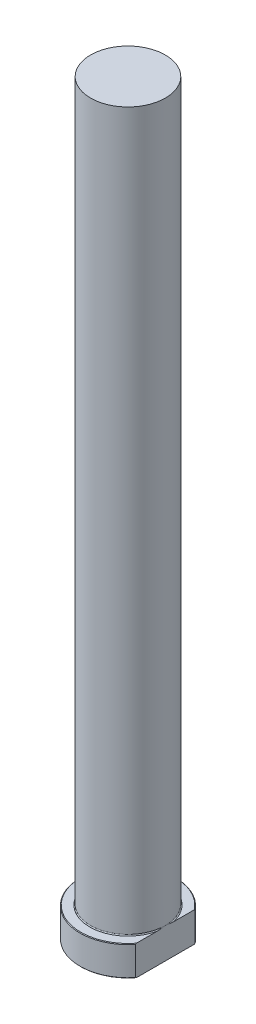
ISO-10303-21;
HEADER;
FILE_DESCRIPTION(('STEP AP214'),'2;1');
FILE_NAME('part.step','',(''),(''),'','','');
FILE_SCHEMA(('AUTOMOTIVE_DESIGN { 1 0 10303 214 1 1 1 1 }'));
ENDSEC;
DATA;
#1=APPLICATION_CONTEXT('core data for automotive mechanical design processes');
#2=APPLICATION_PROTOCOL_DEFINITION('international standard','automotive_design',2000,#1);
#3=PRODUCT_CONTEXT('',#1,'mechanical');
#4=PRODUCT('Part','Part','',(#3));
#5=PRODUCT_RELATED_PRODUCT_CATEGORY('part','',(#4));
#6=PRODUCT_DEFINITION_FORMATION('','',#4);
#7=PRODUCT_DEFINITION_CONTEXT('part definition',#1,'design');
#8=PRODUCT_DEFINITION('design','',#6,#7);
#9=PRODUCT_DEFINITION_SHAPE('','',#8);
#10=(LENGTH_UNIT() NAMED_UNIT(*) SI_UNIT(.MILLI.,.METRE.));
#11=(NAMED_UNIT(*) PLANE_ANGLE_UNIT() SI_UNIT($,.RADIAN.));
#12=(NAMED_UNIT(*) SI_UNIT($,.STERADIAN.) SOLID_ANGLE_UNIT());
#13=UNCERTAINTY_MEASURE_WITH_UNIT(LENGTH_MEASURE(1.E-05),#10,'distance_accuracy_value','');
#14=(GEOMETRIC_REPRESENTATION_CONTEXT(3) GLOBAL_UNCERTAINTY_ASSIGNED_CONTEXT((#13)) GLOBAL_UNIT_ASSIGNED_CONTEXT((#10,
#11,#12)) REPRESENTATION_CONTEXT('',''));
#15=CARTESIAN_POINT('',(0.,0.,0.));
#16=DIRECTION('',(0.,0.,1.));
#17=DIRECTION('',(1.,0.,0.));
#18=AXIS2_PLACEMENT_3D('',#15,#16,#17);
#19=CARTESIAN_POINT('',(0.,0.,0.));
#20=DIRECTION('',(0.,-1.,0.));
#21=DIRECTION('',(0.,0.,-1.));
#22=AXIS2_PLACEMENT_3D('',#19,#20,#21);
#23=PLANE('',#22);
#24=CARTESIAN_POINT('',(0.,0.,0.));
#25=DIRECTION('',(0.,-1.,0.));
#26=DIRECTION('',(0.,0.,-1.));
#27=AXIS2_PLACEMENT_3D('',#24,#25,#26);
#28=CIRCLE('',#27,15.8);
#29=CARTESIAN_POINT('',(12.5,0.,9.6638501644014));
#30=VERTEX_POINT('',#29);
#31=CARTESIAN_POINT('',(12.5,0.,-9.6638501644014));
#32=VERTEX_POINT('',#31);
#33=EDGE_CURVE('E98',#30,#32,#28,.T.);
#34=ORIENTED_EDGE('',*,*,#33,.T.);
#35=DIRECTION('',(0.,0.,1.));
#36=VECTOR('',#35,1.);
#37=CARTESIAN_POINT('',(12.5,0.,-9.98749217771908));
#38=LINE('',#37,#36);
#39=EDGE_CURVE('E83',#32,#30,#38,.T.);
#40=ORIENTED_EDGE('',*,*,#39,.T.);
#41=EDGE_LOOP('',(#34,#40));
#42=FACE_BOUND('',#41,.T.);
#43=ADVANCED_FACE('F32',(#42),#23,.T.);
#44=CARTESIAN_POINT('',(0.,259.958771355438,0.));
#45=DIRECTION('',(0.,1.,0.));
#46=DIRECTION('',(0.,0.,1.));
#47=AXIS2_PLACEMENT_3D('',#44,#45,#46);
#48=CYLINDRICAL_SURFACE('',#47,16.);
#49=CARTESIAN_POINT('',(0.,9.80000000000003,0.));
#50=DIRECTION('',(0.,1.,0.));
#51=DIRECTION('',(0.,0.,1.));
#52=AXIS2_PLACEMENT_3D('',#49,#50,#51);
#53=CIRCLE('',#52,16.);
#54=CARTESIAN_POINT('',(12.5,9.80000000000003,9.98749217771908));
#55=VERTEX_POINT('',#54);
#56=CARTESIAN_POINT('',(12.5,9.80000000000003,-9.98749217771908));
#57=VERTEX_POINT('',#56);
#58=EDGE_CURVE('E104',#55,#57,#53,.F.);
#59=ORIENTED_EDGE('',*,*,#58,.T.);
#60=DIRECTION('',(0.,-1.,0.));
#61=VECTOR('',#60,1.);
#62=CARTESIAN_POINT('',(12.5,250.,-9.98749217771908));
#63=LINE('',#62,#61);
#64=CARTESIAN_POINT('',(12.5,0.199999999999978,-9.98749217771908));
#65=VERTEX_POINT('',#64);
#66=EDGE_CURVE('E183',#57,#65,#63,.T.);
#67=ORIENTED_EDGE('',*,*,#66,.T.);
#68=CARTESIAN_POINT('',(0.,0.199999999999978,0.));
#69=DIRECTION('',(0.,-1.,0.));
#70=DIRECTION('',(0.,0.,-1.));
#71=AXIS2_PLACEMENT_3D('',#68,#69,#70);
#72=CIRCLE('',#71,16.);
#73=CARTESIAN_POINT('',(12.5,0.199999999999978,9.98749217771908));
#74=VERTEX_POINT('',#73);
#75=EDGE_CURVE('E100',#65,#74,#72,.F.);
#76=ORIENTED_EDGE('',*,*,#75,.T.);
#77=DIRECTION('',(0.,-1.,0.));
#78=VECTOR('',#77,1.);
#79=CARTESIAN_POINT('',(12.5,250.,9.98749217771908));
#80=LINE('',#79,#78);
#81=EDGE_CURVE('E93',#55,#74,#80,.T.);
#82=ORIENTED_EDGE('',*,*,#81,.F.);
#83=EDGE_LOOP('',(#59,#67,#76,#82));
#84=FACE_BOUND('',#83,.T.);
#85=ADVANCED_FACE('F158',(#84),#48,.T.);
#86=CARTESIAN_POINT('',(-16.,10.,0.));
#87=DIRECTION('',(0.,1.,0.));
#88=DIRECTION('',(0.,0.,1.));
#89=AXIS2_PLACEMENT_3D('',#86,#87,#88);
#90=PLANE('',#89);
#91=CARTESIAN_POINT('',(0.,10.,0.));
#92=DIRECTION('',(0.,1.,0.));
#93=DIRECTION('',(0.,0.,1.));
#94=AXIS2_PLACEMENT_3D('',#91,#92,#93);
#95=CIRCLE('',#94,15.8);
#96=CARTESIAN_POINT('',(12.5,10.,-9.66385016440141));
#97=VERTEX_POINT('',#96);
#98=CARTESIAN_POINT('',(12.5,10.,9.66385016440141));
#99=VERTEX_POINT('',#98);
#100=EDGE_CURVE('E178',#97,#99,#95,.T.);
#101=ORIENTED_EDGE('',*,*,#100,.T.);
#102=DIRECTION('',(0.,0.,-1.));
#103=VECTOR('',#102,1.);
#104=CARTESIAN_POINT('',(12.5,10.,0.));
#105=LINE('',#104,#103);
#106=CARTESIAN_POINT('',(12.5,10.,2.75499546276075));
#107=VERTEX_POINT('',#106);
#108=EDGE_CURVE('E57',#99,#107,#105,.T.);
#109=ORIENTED_EDGE('',*,*,#108,.T.);
#110=CARTESIAN_POINT('',(0.,10.,0.));
#111=DIRECTION('',(0.,1.,0.));
#112=DIRECTION('',(0.,0.,1.));
#113=AXIS2_PLACEMENT_3D('',#110,#111,#112);
#114=CIRCLE('',#113,12.8);
#115=CARTESIAN_POINT('',(12.5,10.,-2.75499546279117));
#116=VERTEX_POINT('',#115);
#117=EDGE_CURVE('E107',#107,#116,#114,.F.);
#118=ORIENTED_EDGE('',*,*,#117,.T.);
#119=EDGE_CURVE('E136',#116,#97,#105,.T.);
#120=ORIENTED_EDGE('',*,*,#119,.T.);
#121=EDGE_LOOP('',(#101,#109,#118,#120));
#122=FACE_BOUND('',#121,.T.);
#123=ADVANCED_FACE('F147',(#122),#90,.T.);
#124=CARTESIAN_POINT('',(0.,10.,0.));
#125=DIRECTION('',(0.,-1.,0.));
#126=DIRECTION('',(0.,0.,-1.));
#127=AXIS2_PLACEMENT_3D('',#124,#125,#126);
#128=CONICAL_SURFACE('',#127,15.8,0.785398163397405);
#129=ORIENTED_EDGE('',*,*,#58,.F.);
#130=CARTESIAN_POINT('',(12.5,0.520063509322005,21.9732835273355));
#131=CARTESIAN_POINT('',(12.5,0.802025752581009,21.6488770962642));
#132=CARTESIAN_POINT('',(12.5,1.08313217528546,21.3237240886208));
#133=CARTESIAN_POINT('',(12.5,1.64338244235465,20.6717229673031));
#134=CARTESIAN_POINT('',(12.5,1.92252625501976,20.3448748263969));
#135=CARTESIAN_POINT('',(12.5,2.47872061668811,19.6891394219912));
#136=CARTESIAN_POINT('',(12.5,2.75577013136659,19.3602512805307));
#137=CARTESIAN_POINT('',(12.5,3.30732757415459,18.7003513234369));
#138=CARTESIAN_POINT('',(12.5,3.58183551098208,18.3693395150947));
#139=CARTESIAN_POINT('',(12.5,4.13404626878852,17.6974852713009));
#140=CARTESIAN_POINT('',(12.5,4.41168315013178,17.356588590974));
#141=CARTESIAN_POINT('',(12.5,4.96342557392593,16.6719500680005));
#142=CARTESIAN_POINT('',(12.5,5.23753113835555,16.3282082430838));
#143=CARTESIAN_POINT('',(12.5,5.78155974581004,15.6375575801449));
#144=CARTESIAN_POINT('',(12.5,6.0514837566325,15.2906495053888));
#145=CARTESIAN_POINT('',(12.5,6.5864910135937,14.5931154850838));
#146=CARTESIAN_POINT('',(12.5,6.85157426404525,14.2424895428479));
#147=CARTESIAN_POINT('',(12.5,7.37633965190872,13.5365100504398));
#148=CARTESIAN_POINT('',(12.5,7.63601439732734,13.1811509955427));
#149=CARTESIAN_POINT('',(12.5,8.14848411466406,12.4654890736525));
#150=CARTESIAN_POINT('',(12.5,8.4012790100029,12.1051861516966));
#151=CARTESIAN_POINT('',(12.5,8.89877262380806,11.3785626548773));
#152=CARTESIAN_POINT('',(12.5,9.14346420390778,11.0122371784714));
#153=CARTESIAN_POINT('',(12.5,9.62269650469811,10.2729925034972));
#154=CARTESIAN_POINT('',(12.5,9.85723744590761,9.90007344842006));
#155=CARTESIAN_POINT('',(12.5,10.3121733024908,9.14938704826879));
#156=CARTESIAN_POINT('',(12.5,10.5326589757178,8.77167495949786));
#157=CARTESIAN_POINT('',(12.5,10.9584323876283,8.00766886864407));
#158=CARTESIAN_POINT('',(12.5,11.1637182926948,7.62137383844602));
#159=CARTESIAN_POINT('',(12.5,11.5550521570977,6.83979556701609));
#160=CARTESIAN_POINT('',(12.5,11.7411279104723,6.44452635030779));
#161=CARTESIAN_POINT('',(12.5,12.0896891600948,5.64379531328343));
#162=CARTESIAN_POINT('',(12.5,12.2521837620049,5.23833749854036));
#163=CARTESIAN_POINT('',(12.5,12.5515074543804,4.40750298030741));
#164=CARTESIAN_POINT('',(12.5,12.6876692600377,3.98188300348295));
#165=CARTESIAN_POINT('',(12.5,12.9230664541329,3.12036018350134));
#166=CARTESIAN_POINT('',(12.5,13.0223077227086,2.6844589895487));
#167=CARTESIAN_POINT('',(12.5,13.1386499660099,2.02637177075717));
#168=CARTESIAN_POINT('',(12.5,13.1719581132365,1.80697979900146));
#169=CARTESIAN_POINT('',(12.5,13.227389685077,1.36679892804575));
#170=CARTESIAN_POINT('',(12.5,13.2495147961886,1.14601024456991));
#171=CARTESIAN_POINT('',(12.5,13.2821590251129,0.703578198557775));
#172=CARTESIAN_POINT('',(12.5,13.2926782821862,0.481934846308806));
#173=CARTESIAN_POINT('',(12.5,13.3019073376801,0.0383999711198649));
#174=CARTESIAN_POINT('',(12.5,13.300617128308,-0.18349155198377));
#175=CARTESIAN_POINT('',(12.5,13.2862386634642,-0.627300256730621));
#176=CARTESIAN_POINT('',(12.5,13.2731286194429,-0.849216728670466));
#177=CARTESIAN_POINT('',(12.5,13.2353379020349,-1.2920567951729));
#178=CARTESIAN_POINT('',(12.5,13.2106571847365,-1.51298038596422));
#179=CARTESIAN_POINT('',(12.5,13.150182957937,-1.95331306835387));
#180=CARTESIAN_POINT('',(12.5,13.114388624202,-2.17272204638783));
#181=CARTESIAN_POINT('',(12.5,13.032312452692,-2.60958138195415));
#182=CARTESIAN_POINT('',(12.5,12.9860290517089,-2.8270314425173));
#183=CARTESIAN_POINT('',(12.5,12.8318007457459,-3.47896053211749));
#184=CARTESIAN_POINT('',(12.5,12.7089145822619,-3.90995974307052));
#185=CARTESIAN_POINT('',(12.5,12.4301044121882,-4.76088311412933));
#186=CARTESIAN_POINT('',(12.5,12.2741797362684,-5.1808070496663));
#187=CARTESIAN_POINT('',(12.5,11.8998555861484,-6.09704545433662));
#188=CARTESIAN_POINT('',(12.5,11.6752155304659,-6.59079268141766));
#189=CARTESIAN_POINT('',(12.5,11.1959254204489,-7.56361802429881));
#190=CARTESIAN_POINT('',(12.5,10.941258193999,-8.04268754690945));
#191=CARTESIAN_POINT('',(12.5,10.4085643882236,-8.98884891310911));
#192=CARTESIAN_POINT('',(12.5,10.1304909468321,-9.4559141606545));
#193=CARTESIAN_POINT('',(12.5,9.55679554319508,-10.3789360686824));
#194=CARTESIAN_POINT('',(12.5,9.26117703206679,-10.8348948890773));
#195=CARTESIAN_POINT('',(12.5,8.65460060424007,-11.7400212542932));
#196=CARTESIAN_POINT('',(12.5,8.34356847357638,-12.1891388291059));
#197=CARTESIAN_POINT('',(12.5,7.71056360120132,-13.0795913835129));
#198=CARTESIAN_POINT('',(12.5,7.38859046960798,-13.520926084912));
#199=CARTESIAN_POINT('',(12.5,6.73627073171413,-14.3965599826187));
#200=CARTESIAN_POINT('',(12.5,6.40593412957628,-14.8308666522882));
#201=CARTESIAN_POINT('',(12.5,5.73818513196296,-15.6939842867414));
#202=CARTESIAN_POINT('',(12.5,5.40077283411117,-16.1227953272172));
#203=CARTESIAN_POINT('',(12.5,4.69065889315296,-17.0127103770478));
#204=CARTESIAN_POINT('',(12.5,4.31743190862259,-17.4733945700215));
#205=CARTESIAN_POINT('',(12.5,3.56536441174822,-18.3901509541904));
#206=CARTESIAN_POINT('',(12.5,3.18652389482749,-18.846223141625));
#207=CARTESIAN_POINT('',(12.5,2.42850462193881,-19.7493414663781));
#208=CARTESIAN_POINT('',(12.5,2.04937794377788,-20.196431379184));
#209=CARTESIAN_POINT('',(12.5,1.28737664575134,-21.0872319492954));
#210=CARTESIAN_POINT('',(12.5,0.90450289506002,-21.5309433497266));
#211=CARTESIAN_POINT('',(12.5,0.520063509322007,-21.9732835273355));
#212=B_SPLINE_CURVE_WITH_KNOTS('',3,(#130,#131,#132,#133,#134,#135,#136,#137,#138,#139,#140,
#141,#142,#143,#144,#145,#146,#147,#148,#149,#150,#151,#152,#153,#154,#155,#156,#157,#158,#159,
#160,#161,#162,#163,#164,#165,#166,#167,#168,#169,#170,#171,#172,#173,#174,#175,#176,#177,#178,
#179,#180,#181,#182,#183,#184,#185,#186,#187,#188,#189,#190,#191,#192,#193,#194,#195,#196,#197,
#198,#199,#200,#201,#202,#203,#204,#205,#206,#207,#208,#209,#210,#211),.UNSPECIFIED.,.F.,.F.,(4,
2,2,2,2,2,2,2,2,2,2,2,2,2,2,2,2,2,2,2,2,2,2,2,2,2,2,2,2,2,2,2,2,2,2,2,2,2,2,2,4),(0.,
1.2894511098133,2.57892299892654,3.86899482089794,5.15906221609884,6.47799420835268,
7.79691798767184,9.11553180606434,10.4341444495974,11.7544545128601,13.0747792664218,
14.3962377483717,15.7176675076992,17.0294519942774,18.3413944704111,19.6514113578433,
20.9609210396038,22.3001940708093,23.6392537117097,24.3047314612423,24.9701088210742,
25.635478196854,26.3008480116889,26.9674468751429,27.6340482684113,28.3006991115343,
28.9674493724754,30.3101828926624,31.6529436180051,33.2788964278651,34.9057836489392,
36.5360093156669,38.1659153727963,39.8046231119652,41.4433893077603,43.0802801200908,
44.7171483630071,46.4957886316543,48.2744303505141,50.0329971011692,51.7911651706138),.UNSPECIFIED.);
#213=EDGE_CURVE('E135',#55,#99,#212,.T.);
#214=ORIENTED_EDGE('',*,*,#213,.T.);
#215=ORIENTED_EDGE('',*,*,#100,.F.);
#216=EDGE_CURVE('E127',#97,#57,#212,.T.);
#217=ORIENTED_EDGE('',*,*,#216,.T.);
#218=EDGE_LOOP('',(#129,#214,#215,#217));
#219=FACE_BOUND('',#218,.T.);
#220=ADVANCED_FACE('F143',(#219),#128,.T.);
#221=CARTESIAN_POINT('',(0.,0.199999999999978,0.));
#222=DIRECTION('',(0.,1.,0.));
#223=DIRECTION('',(0.,0.,1.));
#224=AXIS2_PLACEMENT_3D('',#221,#222,#223);
#225=CONICAL_SURFACE('',#224,16.,0.785398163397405);
#226=ORIENTED_EDGE('',*,*,#75,.F.);
#227=CARTESIAN_POINT('',(12.5,9.47993649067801,-21.9732835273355));
#228=CARTESIAN_POINT('',(12.5,9.197974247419,-21.6488770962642));
#229=CARTESIAN_POINT('',(12.5,8.91686782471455,-21.3237240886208));
#230=CARTESIAN_POINT('',(12.5,8.35661755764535,-20.6717229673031));
#231=CARTESIAN_POINT('',(12.5,8.07747374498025,-20.3448748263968));
#232=CARTESIAN_POINT('',(12.5,7.52127938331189,-19.6891394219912));
#233=CARTESIAN_POINT('',(12.5,7.24422986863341,-19.3602512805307));
#234=CARTESIAN_POINT('',(12.5,6.69267242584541,-18.7003513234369));
#235=CARTESIAN_POINT('',(12.5,6.41816448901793,-18.3693395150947));
#236=CARTESIAN_POINT('',(12.5,5.86595373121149,-17.6974852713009));
#237=CARTESIAN_POINT('',(12.5,5.58831684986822,-17.356588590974));
#238=CARTESIAN_POINT('',(12.5,5.03657442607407,-16.6719500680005));
#239=CARTESIAN_POINT('',(12.5,4.76246886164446,-16.3282082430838));
#240=CARTESIAN_POINT('',(12.5,4.21844025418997,-15.6375575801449));
#241=CARTESIAN_POINT('',(12.5,3.9485162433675,-15.2906495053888));
#242=CARTESIAN_POINT('',(12.5,3.41350898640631,-14.5931154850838));
#243=CARTESIAN_POINT('',(12.5,3.14842573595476,-14.2424895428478));
#244=CARTESIAN_POINT('',(12.5,2.62366034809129,-13.5365100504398));
#245=CARTESIAN_POINT('',(12.5,2.36398560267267,-13.1811509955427));
#246=CARTESIAN_POINT('',(12.5,1.85151588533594,-12.4654890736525));
#247=CARTESIAN_POINT('',(12.5,1.5987209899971,-12.1051861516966));
#248=CARTESIAN_POINT('',(12.5,1.10122737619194,-11.3785626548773));
#249=CARTESIAN_POINT('',(12.5,0.85653579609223,-11.0122371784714));
#250=CARTESIAN_POINT('',(12.5,0.377303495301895,-10.2729925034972));
#251=CARTESIAN_POINT('',(12.5,0.142762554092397,-9.90007344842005));
#252=CARTESIAN_POINT('',(12.5,-0.312173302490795,-9.14938704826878));
#253=CARTESIAN_POINT('',(12.5,-0.532658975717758,-8.77167495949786));
#254=CARTESIAN_POINT('',(12.5,-0.95843238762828,-8.00766886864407));
#255=CARTESIAN_POINT('',(12.5,-1.16371829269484,-7.62137383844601));
#256=CARTESIAN_POINT('',(12.5,-1.55505215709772,-6.83979556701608));
#257=CARTESIAN_POINT('',(12.5,-1.74112791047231,-6.44452635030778));
#258=CARTESIAN_POINT('',(12.5,-2.08968916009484,-5.64379531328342));
#259=CARTESIAN_POINT('',(12.5,-2.2521837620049,-5.23833749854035));
#260=CARTESIAN_POINT('',(12.5,-2.55150745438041,-4.4075029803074));
#261=CARTESIAN_POINT('',(12.5,-2.68766926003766,-3.98188300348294));
#262=CARTESIAN_POINT('',(12.5,-2.92306645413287,-3.12036018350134));
#263=CARTESIAN_POINT('',(12.5,-3.0223077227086,-2.6844589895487));
#264=CARTESIAN_POINT('',(12.5,-3.13864996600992,-2.02637177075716));
#265=CARTESIAN_POINT('',(12.5,-3.17195811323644,-1.80697979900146));
#266=CARTESIAN_POINT('',(12.5,-3.22738968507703,-1.36679892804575));
#267=CARTESIAN_POINT('',(12.5,-3.24951479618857,-1.14601024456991));
#268=CARTESIAN_POINT('',(12.5,-3.28215902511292,-0.703578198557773));
#269=CARTESIAN_POINT('',(12.5,-3.29267828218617,-0.481934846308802));
#270=CARTESIAN_POINT('',(12.5,-3.30190733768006,-0.0383999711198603));
#271=CARTESIAN_POINT('',(12.5,-3.30061712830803,0.183491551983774));
#272=CARTESIAN_POINT('',(12.5,-3.28623866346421,0.627300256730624));
#273=CARTESIAN_POINT('',(12.5,-3.27312861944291,0.849216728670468));
#274=CARTESIAN_POINT('',(12.5,-3.23533790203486,1.2920567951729));
#275=CARTESIAN_POINT('',(12.5,-3.21065718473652,1.51298038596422));
#276=CARTESIAN_POINT('',(12.5,-3.15018295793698,1.95331306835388));
#277=CARTESIAN_POINT('',(12.5,-3.11438862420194,2.17272204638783));
#278=CARTESIAN_POINT('',(12.5,-3.03231245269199,2.60958138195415));
#279=CARTESIAN_POINT('',(12.5,-2.98602905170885,2.82703144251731));
#280=CARTESIAN_POINT('',(12.5,-2.83180074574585,3.47896053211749));
#281=CARTESIAN_POINT('',(12.5,-2.7089145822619,3.90995974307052));
#282=CARTESIAN_POINT('',(12.5,-2.43010441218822,4.76088311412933));
#283=CARTESIAN_POINT('',(12.5,-2.27417973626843,5.1808070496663));
#284=CARTESIAN_POINT('',(12.5,-1.89985558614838,6.09704545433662));
#285=CARTESIAN_POINT('',(12.5,-1.67521553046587,6.59079268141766));
#286=CARTESIAN_POINT('',(12.5,-1.19592542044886,7.56361802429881));
#287=CARTESIAN_POINT('',(12.5,-0.941258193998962,8.04268754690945));
#288=CARTESIAN_POINT('',(12.5,-0.408564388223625,8.98884891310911));
#289=CARTESIAN_POINT('',(12.5,-0.130490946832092,9.4559141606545));
#290=CARTESIAN_POINT('',(12.5,0.44320445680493,10.3789360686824));
#291=CARTESIAN_POINT('',(12.5,0.738822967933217,10.8348948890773));
#292=CARTESIAN_POINT('',(12.5,1.34539939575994,11.7400212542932));
#293=CARTESIAN_POINT('',(12.5,1.65643152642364,12.1891388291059));
#294=CARTESIAN_POINT('',(12.5,2.28943639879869,13.0795913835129));
#295=CARTESIAN_POINT('',(12.5,2.61140953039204,13.520926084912));
#296=CARTESIAN_POINT('',(12.5,3.26372926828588,14.3965599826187));
#297=CARTESIAN_POINT('',(12.5,3.59406587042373,14.8308666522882));
#298=CARTESIAN_POINT('',(12.5,4.26181486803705,15.6939842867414));
#299=CARTESIAN_POINT('',(12.5,4.59922716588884,16.1227953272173));
#300=CARTESIAN_POINT('',(12.5,5.30934110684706,17.0127103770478));
#301=CARTESIAN_POINT('',(12.5,5.68256809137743,17.4733945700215));
#302=CARTESIAN_POINT('',(12.5,6.43463558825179,18.3901509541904));
#303=CARTESIAN_POINT('',(12.5,6.81347610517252,18.846223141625));
#304=CARTESIAN_POINT('',(12.5,7.5714953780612,19.7493414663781));
#305=CARTESIAN_POINT('',(12.5,7.95062205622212,20.196431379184));
#306=CARTESIAN_POINT('',(12.5,8.71262335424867,21.0872319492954));
#307=CARTESIAN_POINT('',(12.5,9.09549710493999,21.5309433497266));
#308=CARTESIAN_POINT('',(12.5,9.479936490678,21.9732835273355));
#309=B_SPLINE_CURVE_WITH_KNOTS('',3,(#227,#228,#229,#230,#231,#232,#233,#234,#235,#236,#237,
#238,#239,#240,#241,#242,#243,#244,#245,#246,#247,#248,#249,#250,#251,#252,#253,#254,#255,#256,
#257,#258,#259,#260,#261,#262,#263,#264,#265,#266,#267,#268,#269,#270,#271,#272,#273,#274,#275,
#276,#277,#278,#279,#280,#281,#282,#283,#284,#285,#286,#287,#288,#289,#290,#291,#292,#293,#294,
#295,#296,#297,#298,#299,#300,#301,#302,#303,#304,#305,#306,#307,#308),.UNSPECIFIED.,.F.,.F.,(4,
2,2,2,2,2,2,2,2,2,2,2,2,2,2,2,2,2,2,2,2,2,2,2,2,2,2,2,2,2,2,2,2,2,2,2,2,2,2,2,4),(0.,
1.2894511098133,2.57892299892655,3.86899482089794,5.15906221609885,6.47799420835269,
7.79691798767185,9.11553180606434,10.4341444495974,11.7544545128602,13.0747792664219,
14.3962377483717,15.7176675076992,17.0294519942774,18.3413944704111,19.6514113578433,
20.9609210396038,22.3001940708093,23.6392537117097,24.3047314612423,24.9701088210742,
25.635478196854,26.3008480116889,26.9674468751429,27.6340482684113,28.3006991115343,
28.9674493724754,30.3101828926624,31.6529436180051,33.2788964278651,34.9057836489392,
36.5360093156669,38.1659153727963,39.8046231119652,41.4433893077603,43.0802801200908,
44.7171483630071,46.4957886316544,48.2744303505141,50.0329971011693,51.7911651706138),.UNSPECIFIED.);
#310=EDGE_CURVE('E86',#65,#32,#309,.T.);
#311=ORIENTED_EDGE('',*,*,#310,.T.);
#312=ORIENTED_EDGE('',*,*,#33,.F.);
#313=EDGE_CURVE('E89',#30,#74,#309,.T.);
#314=ORIENTED_EDGE('',*,*,#313,.T.);
#315=EDGE_LOOP('',(#226,#311,#312,#314));
#316=FACE_BOUND('',#315,.T.);
#317=ADVANCED_FACE('F97',(#316),#225,.T.);
#318=CARTESIAN_POINT('',(0.,10.3,0.));
#319=DIRECTION('',(0.,1.,0.));
#320=DIRECTION('',(0.,0.,1.));
#321=AXIS2_PLACEMENT_3D('',#318,#319,#320);
#322=TOROIDAL_SURFACE('',#321,12.8,0.3);
#323=CARTESIAN_POINT('',(12.5,10.3,0.));
#324=CARTESIAN_POINT('',(12.5,10.300000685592,-6.08820746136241E-09));
#325=CARTESIAN_POINT('',(12.5,10.300001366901,-5.08876655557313E-07));
#326=CARTESIAN_POINT('',(12.5,10.3000026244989,-1.73661802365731E-06));
#327=CARTESIAN_POINT('',(12.5,10.3000031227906,-2.48490474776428E-06));
#328=CARTESIAN_POINT('',(12.5,10.3000042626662,-4.35291163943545E-06));
#329=CARTESIAN_POINT('',(12.5,10.3000048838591,-5.50325566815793E-06));
#330=CARTESIAN_POINT('',(12.5,10.3000058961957,-7.76527023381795E-06));
#331=CARTESIAN_POINT('',(12.5,10.3000063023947,-8.87193032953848E-06));
#332=CARTESIAN_POINT('',(12.5,10.3000080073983,-1.35535117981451E-05));
#333=CARTESIAN_POINT('',(12.5,10.300009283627,-1.71478698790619E-05));
#334=CARTESIAN_POINT('',(12.5,10.3000111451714,-2.39305737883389E-05));
#335=CARTESIAN_POINT('',(12.5,10.30001180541,-2.70989461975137E-05));
#336=CARTESIAN_POINT('',(12.5,10.3000165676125,-5.05411717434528E-05));
#337=CARTESIAN_POINT('',(12.5,10.3000200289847,-7.09185071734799E-05));
#338=CARTESIAN_POINT('',(12.5,10.300032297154,-0.000151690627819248));
#339=CARTESIAN_POINT('',(12.5,10.3000383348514,-0.000212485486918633));
#340=CARTESIAN_POINT('',(12.5,10.3000659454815,-0.000448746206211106));
#341=CARTESIAN_POINT('',(12.5,10.3000952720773,-0.000623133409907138));
#342=CARTESIAN_POINT('',(12.5,10.3002039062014,-0.00128772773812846));
#343=CARTESIAN_POINT('',(12.5,10.3002776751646,-0.00177866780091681));
#344=CARTESIAN_POINT('',(12.5,10.3005641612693,-0.00366503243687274));
#345=CARTESIAN_POINT('',(12.5,10.3007823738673,-0.00505974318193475));
#346=CARTESIAN_POINT('',(12.5,10.3018133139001,-0.0116680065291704));
#347=CARTESIAN_POINT('',(12.5,10.3026180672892,-0.0168825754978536));
#348=CARTESIAN_POINT('',(12.5,10.3120514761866,-0.0779781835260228));
#349=CARTESIAN_POINT('',(12.5,10.3207244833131,-0.133853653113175));
#350=CARTESIAN_POINT('',(12.5,10.3388658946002,-0.251282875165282));
#351=CARTESIAN_POINT('',(12.5,10.3483257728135,-0.312837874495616));
#352=CARTESIAN_POINT('',(12.5,10.3639287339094,-0.415046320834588));
#353=CARTESIAN_POINT('',(12.5,10.3701065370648,-0.455694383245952));
#354=CARTESIAN_POINT('',(12.5,10.3822268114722,-0.53596333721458));
#355=CARTESIAN_POINT('',(12.5,10.3881712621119,-0.57558393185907));
#356=CARTESIAN_POINT('',(12.5,10.4217048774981,-0.800849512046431));
#357=CARTESIAN_POINT('',(12.5,10.4483430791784,-0.986638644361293));
#358=CARTESIAN_POINT('',(12.5,10.4978676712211,-1.36073085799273));
#359=CARTESIAN_POINT('',(12.5,10.5207116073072,-1.54903981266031));
#360=CARTESIAN_POINT('',(12.5,10.5510813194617,-1.84372746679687));
#361=CARTESIAN_POINT('',(12.5,10.5609338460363,-1.94986334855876));
#362=CARTESIAN_POINT('',(12.5,10.5778401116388,-2.16235517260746));
#363=CARTESIAN_POINT('',(12.5,10.5848941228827,-2.26871109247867));
#364=CARTESIAN_POINT('',(12.5,10.5953321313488,-2.48120575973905));
#365=CARTESIAN_POINT('',(12.5,10.5987299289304,-2.58734380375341));
#366=CARTESIAN_POINT('',(12.5,10.6006981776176,-2.79965289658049));
#367=CARTESIAN_POINT('',(12.5,10.5992708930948,-2.90582390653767));
#368=CARTESIAN_POINT('',(12.5,10.5920660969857,-3.06242328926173));
#369=CARTESIAN_POINT('',(12.5,10.5889531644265,-3.11297361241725));
#370=CARTESIAN_POINT('',(12.5,10.5807735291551,-3.21396863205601));
#371=CARTESIAN_POINT('',(12.5,10.5757051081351,-3.26441319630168));
#372=CARTESIAN_POINT('',(12.5,10.5631618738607,-3.36425835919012));
#373=CARTESIAN_POINT('',(12.5,10.555723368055,-3.41366343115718));
#374=CARTESIAN_POINT('',(12.5,10.5375916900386,-3.51185380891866));
#375=CARTESIAN_POINT('',(12.5,10.5269024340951,-3.56063978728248));
#376=CARTESIAN_POINT('',(12.5,10.5054348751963,-3.6391830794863));
#377=CARTESIAN_POINT('',(12.5,10.4961365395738,-3.66933696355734));
#378=CARTESIAN_POINT('',(12.5,10.474763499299,-3.72862196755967));
#379=CARTESIAN_POINT('',(12.5,10.462694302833,-3.75775498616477));
#380=CARTESIAN_POINT('',(12.5,10.4380385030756,-3.80618627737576));
#381=CARTESIAN_POINT('',(12.5,10.4265070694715,-3.8259857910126));
#382=CARTESIAN_POINT('',(12.5,10.4063926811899,-3.85382979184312));
#383=CARTESIAN_POINT('',(12.5,10.3991733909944,-3.8628437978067));
#384=CARTESIAN_POINT('',(12.5,10.3835233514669,-3.87975615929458));
#385=CARTESIAN_POINT('',(12.5,10.3750969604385,-3.88765833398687));
#386=CARTESIAN_POINT('',(12.5,10.3611065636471,-3.89824999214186));
#387=CARTESIAN_POINT('',(12.5,10.3560749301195,-3.9016366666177));
#388=CARTESIAN_POINT('',(12.5,10.3455861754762,-3.90768435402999));
#389=CARTESIAN_POINT('',(12.5,10.3401292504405,-3.91034569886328));
#390=CARTESIAN_POINT('',(12.5,10.3287657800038,-3.91474619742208));
#391=CARTESIAN_POINT('',(12.5,10.3228544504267,-3.91647335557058));
#392=CARTESIAN_POINT('',(12.5,10.3108092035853,-3.91873417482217));
#393=CARTESIAN_POINT('',(12.5,10.3046756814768,-3.91926985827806));
#394=CARTESIAN_POINT('',(12.5,10.293185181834,-3.91908606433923));
#395=CARTESIAN_POINT('',(12.5,10.2878253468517,-3.91851265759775));
#396=CARTESIAN_POINT('',(12.5,10.2772818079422,-3.91645967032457));
#397=CARTESIAN_POINT('',(12.5,10.2720982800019,-3.91497921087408));
#398=CARTESIAN_POINT('',(12.5,10.2604757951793,-3.91068184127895));
#399=CARTESIAN_POINT('',(12.5,10.2541380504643,-3.90759459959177));
#400=CARTESIAN_POINT('',(12.5,10.2420308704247,-3.90046137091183));
#401=CARTESIAN_POINT('',(12.5,10.2362627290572,-3.89641326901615));
#402=CARTESIAN_POINT('',(12.5,10.2213149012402,-3.88449159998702));
#403=CARTESIAN_POINT('',(12.5,10.2126659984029,-3.87596096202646));
#404=CARTESIAN_POINT('',(12.5,10.1966439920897,-3.85778795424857));
#405=CARTESIAN_POINT('',(12.5,10.1892747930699,-3.84814232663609));
#406=CARTESIAN_POINT('',(12.5,10.1725709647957,-3.82389784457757));
#407=CARTESIAN_POINT('',(12.5,10.1637497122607,-3.80894948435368));
#408=CARTESIAN_POINT('',(12.5,10.1475318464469,-3.77828784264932));
#409=CARTESIAN_POINT('',(12.5,10.1401383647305,-3.76257297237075));
#410=CARTESIAN_POINT('',(12.5,10.1264047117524,-3.73059893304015));
#411=CARTESIAN_POINT('',(12.5,10.1200701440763,-3.71433738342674));
#412=CARTESIAN_POINT('',(12.5,10.1082745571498,-3.68152468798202));
#413=CARTESIAN_POINT('',(12.5,10.1028126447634,-3.66497385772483));
#414=CARTESIAN_POINT('',(12.5,10.0886990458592,-3.61898372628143));
#415=CARTESIAN_POINT('',(12.5,10.0807822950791,-3.58931942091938));
#416=CARTESIAN_POINT('',(12.5,10.0665587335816,-3.52960268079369));
#417=CARTESIAN_POINT('',(12.5,10.0602528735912,-3.49955002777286));
#418=CARTESIAN_POINT('',(12.5,10.0432020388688,-3.40892020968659));
#419=CARTESIAN_POINT('',(12.5,10.0343558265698,-3.34798718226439));
#420=CARTESIAN_POINT('',(12.5,10.0201228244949,-3.22565891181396));
#421=CARTESIAN_POINT('',(12.5,10.0147414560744,-3.16426309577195));
#422=CARTESIAN_POINT('',(12.5,10.0066240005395,-3.04138251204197));
#423=CARTESIAN_POINT('',(12.5,10.0038844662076,-2.97989796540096));
#424=CARTESIAN_POINT('',(12.5,10.0005131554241,-2.8577235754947));
#425=CARTESIAN_POINT('',(12.5,9.99985290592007,-2.79703443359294));
#426=CARTESIAN_POINT('',(12.5,10.0002004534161,-2.67565900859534));
#427=CARTESIAN_POINT('',(12.5,10.0012083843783,-2.61497272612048));
#428=CARTESIAN_POINT('',(12.5,10.0063170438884,-2.43292800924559));
#429=CARTESIAN_POINT('',(12.5,10.0125034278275,-2.31162822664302));
#430=CARTESIAN_POINT('',(12.5,10.028923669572,-2.06913309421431));
#431=CARTESIAN_POINT('',(12.5,10.0391638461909,-1.94793820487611));
#432=CARTESIAN_POINT('',(12.5,10.0626694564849,-1.70583328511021));
#433=CARTESIAN_POINT('',(12.5,10.0759352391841,-1.58492328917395));
#434=CARTESIAN_POINT('',(12.5,10.1189883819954,-1.22310927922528));
#435=CARTESIAN_POINT('',(12.5,10.1520738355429,-0.982605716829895));
#436=CARTESIAN_POINT('',(12.5,10.2222679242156,-0.502161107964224));
#437=CARTESIAN_POINT('',(12.5,10.2593775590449,-0.262220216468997));
#438=CARTESIAN_POINT('',(12.5,10.2965571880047,-0.0222236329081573));
#439=CARTESIAN_POINT('',(12.5,10.2965669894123,-0.0221603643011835));
#440=CARTESIAN_POINT('',(12.5,10.2972687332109,-0.017630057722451));
#441=CARTESIAN_POINT('',(12.5,10.2979552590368,-0.0131622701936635));
#442=CARTESIAN_POINT('',(12.5,10.2989608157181,-0.00672404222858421));
#443=CARTESIAN_POINT('',(12.5,10.2992709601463,-0.00475237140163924));
#444=CARTESIAN_POINT('',(12.5,10.299665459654,-0.00214447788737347));
#445=CARTESIAN_POINT('',(12.5,10.299760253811,-0.0015097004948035));
#446=CARTESIAN_POINT('',(12.5,10.2998957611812,-0.000678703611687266));
#447=CARTESIAN_POINT('',(12.5,10.2999287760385,-0.000481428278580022));
#448=CARTESIAN_POINT('',(12.5,10.2999592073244,-0.000219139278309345));
#449=CARTESIAN_POINT('',(12.5,10.2999655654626,-0.000155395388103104));
#450=CARTESIAN_POINT('',(12.5,10.2999789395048,-7.14631131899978E-05));
#451=CARTESIAN_POINT('',(12.5,10.2999826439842,-5.07827878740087E-05));
#452=CARTESIAN_POINT('',(12.5,10.2999877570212,-2.70484026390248E-05));
#453=CARTESIAN_POINT('',(12.5,10.2999884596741,-2.3870209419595E-05));
#454=CARTESIAN_POINT('',(12.5,10.2999904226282,-1.70721258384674E-05));
#455=CARTESIAN_POINT('',(12.5,10.2999917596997,-1.34738016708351E-05));
#456=CARTESIAN_POINT('',(12.5,10.2999935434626,-8.79208554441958E-06));
#457=CARTESIAN_POINT('',(12.5,10.2999939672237,-7.68838220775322E-06));
#458=CARTESIAN_POINT('',(12.5,10.2999950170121,-5.43535458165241E-06));
#459=CARTESIAN_POINT('',(12.5,10.2999956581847,-4.29133306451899E-06));
#460=CARTESIAN_POINT('',(12.5,10.2999968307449,-2.43685216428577E-06));
#461=CARTESIAN_POINT('',(12.5,10.29999734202,-1.69517537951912E-06));
#462=CARTESIAN_POINT('',(12.5,10.2999986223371,-4.8608665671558E-07));
#463=CARTESIAN_POINT('',(12.5,10.2999993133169,6.09789656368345E-09));
#464=CARTESIAN_POINT('',(12.5,10.3,0.));
#465=B_SPLINE_CURVE_WITH_KNOTS('',3,(#323,#324,#325,#326,#327,#328,#329,#330,#331,#332,#333,
#334,#335,#336,#337,#338,#339,#340,#341,#342,#343,#344,#345,#346,#347,#348,#349,#350,#351,#352,
#353,#354,#355,#356,#357,#358,#359,#360,#361,#362,#363,#364,#365,#366,#367,#368,#369,#370,#371,
#372,#373,#374,#375,#376,#377,#378,#379,#380,#381,#382,#383,#384,#385,#386,#387,#388,#389,#390,
#391,#392,#393,#394,#395,#396,#397,#398,#399,#400,#401,#402,#403,#404,#405,#406,#407,#408,#409,
#410,#411,#412,#413,#414,#415,#416,#417,#418,#419,#420,#421,#422,#423,#424,#425,#426,#427,#428,
#429,#430,#431,#432,#433,#434,#435,#436,#437,#438,#439,#440,#441,#442,#443,#444,#445,#446,#447,
#448,#449,#450,#451,#452,#453,#454,#455,#456,#457,#458,#459,#460,#461,#462,#463,#464),
.UNSPECIFIED.,.T.,.F.,(4,2,2,2,2,2,2,2,2,2,2,2,2,2,2,2,2,2,2,2,2,2,2,2,2,2,2,2,2,2,2,2,2,2,2,2,
2,2,2,2,2,2,2,2,2,2,2,2,2,2,2,2,2,2,2,2,2,2,2,2,2,2,2,2,2,2,2,2,2,2,4),(0.,2.18904227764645E-06,
4.96900724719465E-06,8.83863216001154E-06,1.23796733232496E-05,2.37905621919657E-05,
3.34897803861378E-05,9.54946146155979E-05,0.000278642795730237,0.000808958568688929,
0.00229845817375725,0.00653331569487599,0.0223624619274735,0.191994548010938,0.378827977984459,
0.502172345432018,0.622364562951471,1.1854146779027,1.75439293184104,2.07414276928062,
2.39386149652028,2.71236916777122,3.0307273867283,3.18263838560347,3.33468317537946,
3.48450253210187,3.63414210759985,3.72872153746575,3.82311455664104,3.89154751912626,
3.92612498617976,3.96058061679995,3.97873163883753,3.9968743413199,4.01524478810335,
4.03358402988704,4.04967096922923,4.06577352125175,4.08680352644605,4.10788025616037,
4.14411883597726,4.18046611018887,4.23240896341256,4.28446448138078,4.3367872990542,
4.389056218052,4.48109408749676,4.57318615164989,4.75772997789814,4.94256185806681,
5.12715223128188,5.30920363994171,5.4912696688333,5.85553516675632,6.22037071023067,
6.58524836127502,7.31345308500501,8.04183912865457,8.04203119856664,8.05559213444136,
8.06157963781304,8.0635052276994,8.06410510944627,8.06429712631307,8.06436014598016,
8.06436990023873,8.06438138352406,8.06438493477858,8.06438881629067,8.06439160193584,
8.06439379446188),.UNSPECIFIED.);
#466=CARTESIAN_POINT('',(12.5,10.3,0.));
#467=VERTEX_POINT('',#466);
#468=EDGE_CURVE('E11',#116,#467,#465,.T.);
#469=ORIENTED_EDGE('',*,*,#468,.F.);
#470=ORIENTED_EDGE('',*,*,#117,.F.);
#471=CARTESIAN_POINT('',(12.5,10.3,0.));
#472=CARTESIAN_POINT('',(12.5,10.299999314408,6.08820735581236E-09));
#473=CARTESIAN_POINT('',(12.5,10.299998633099,5.08876655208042E-07));
#474=CARTESIAN_POINT('',(12.5,10.2999973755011,1.73661802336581E-06));
#475=CARTESIAN_POINT('',(12.5,10.2999968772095,2.48490474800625E-06));
#476=CARTESIAN_POINT('',(12.5,10.2999957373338,4.35291163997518E-06));
#477=CARTESIAN_POINT('',(12.5,10.2999951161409,5.50325566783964E-06));
#478=CARTESIAN_POINT('',(12.5,10.2999941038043,7.76527023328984E-06));
#479=CARTESIAN_POINT('',(12.5,10.2999936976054,8.87193032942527E-06));
#480=CARTESIAN_POINT('',(12.5,10.2999919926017,1.35535117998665E-05));
#481=CARTESIAN_POINT('',(12.5,10.2999907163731,1.71478698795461E-05));
#482=CARTESIAN_POINT('',(12.5,10.2999888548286,2.39305737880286E-05));
#483=CARTESIAN_POINT('',(12.5,10.29998819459,2.70989461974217E-05));
#484=CARTESIAN_POINT('',(12.5,10.2999834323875,5.05411717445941E-05));
#485=CARTESIAN_POINT('',(12.5,10.2999799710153,7.09185071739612E-05));
#486=CARTESIAN_POINT('',(12.5,10.299967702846,0.000151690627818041));
#487=CARTESIAN_POINT('',(12.5,10.2999616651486,0.000212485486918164));
#488=CARTESIAN_POINT('',(12.5,10.2999340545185,0.000448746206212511));
#489=CARTESIAN_POINT('',(12.5,10.2999047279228,0.000623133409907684));
#490=CARTESIAN_POINT('',(12.5,10.2997960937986,0.00128772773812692));
#491=CARTESIAN_POINT('',(12.5,10.2997223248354,0.00177866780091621));
#492=CARTESIAN_POINT('',(12.5,10.2994358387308,0.00366503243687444));
#493=CARTESIAN_POINT('',(12.5,10.2992176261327,0.00505974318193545));
#494=CARTESIAN_POINT('',(12.5,10.2981866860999,0.0116680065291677));
#495=CARTESIAN_POINT('',(12.5,10.2973819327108,0.0168825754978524));
#496=CARTESIAN_POINT('',(12.5,10.2879485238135,0.0779781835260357));
#497=CARTESIAN_POINT('',(12.5,10.2792755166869,0.133853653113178));
#498=CARTESIAN_POINT('',(12.5,10.2611341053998,0.251282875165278));
#499=CARTESIAN_POINT('',(12.5,10.2516742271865,0.312837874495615));
#500=CARTESIAN_POINT('',(12.5,10.2360712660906,0.415046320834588));
#501=CARTESIAN_POINT('',(12.5,10.2298934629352,0.455694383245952));
#502=CARTESIAN_POINT('',(12.5,10.2177731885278,0.53596333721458));
#503=CARTESIAN_POINT('',(12.5,10.2118287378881,0.57558393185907));
#504=CARTESIAN_POINT('',(12.5,10.1782951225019,0.800849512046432));
#505=CARTESIAN_POINT('',(12.5,10.1516569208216,0.986638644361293));
#506=CARTESIAN_POINT('',(12.5,10.1021323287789,1.36073085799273));
#507=CARTESIAN_POINT('',(12.5,10.0792883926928,1.54903981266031));
#508=CARTESIAN_POINT('',(12.5,10.0489186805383,1.84372746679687));
#509=CARTESIAN_POINT('',(12.5,10.0390661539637,1.94986334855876));
#510=CARTESIAN_POINT('',(12.5,10.0221598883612,2.16235517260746));
#511=CARTESIAN_POINT('',(12.5,10.0151058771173,2.26871109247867));
#512=CARTESIAN_POINT('',(12.5,10.0046678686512,2.48120575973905));
#513=CARTESIAN_POINT('',(12.5,10.0012700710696,2.58734380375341));
#514=CARTESIAN_POINT('',(12.5,9.99930182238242,2.79965289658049));
#515=CARTESIAN_POINT('',(12.5,10.0007291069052,2.90582390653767));
#516=CARTESIAN_POINT('',(12.5,10.0079339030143,3.06242328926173));
#517=CARTESIAN_POINT('',(12.5,10.0110468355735,3.11297361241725));
#518=CARTESIAN_POINT('',(12.5,10.0192264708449,3.21396863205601));
#519=CARTESIAN_POINT('',(12.5,10.0242948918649,3.26441319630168));
#520=CARTESIAN_POINT('',(12.5,10.0368381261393,3.36425835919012));
#521=CARTESIAN_POINT('',(12.5,10.044276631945,3.41366343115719));
#522=CARTESIAN_POINT('',(12.5,10.0624083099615,3.51185380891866));
#523=CARTESIAN_POINT('',(12.5,10.0730975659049,3.56063978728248));
#524=CARTESIAN_POINT('',(12.5,10.0945651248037,3.6391830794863));
#525=CARTESIAN_POINT('',(12.5,10.1038634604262,3.66933696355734));
#526=CARTESIAN_POINT('',(12.5,10.125236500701,3.72862196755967));
#527=CARTESIAN_POINT('',(12.5,10.137305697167,3.75775498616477));
#528=CARTESIAN_POINT('',(12.5,10.1619614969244,3.80618627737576));
#529=CARTESIAN_POINT('',(12.5,10.1734929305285,3.8259857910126));
#530=CARTESIAN_POINT('',(12.5,10.1936073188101,3.85382979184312));
#531=CARTESIAN_POINT('',(12.5,10.2008266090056,3.8628437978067));
#532=CARTESIAN_POINT('',(12.5,10.2164766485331,3.87975615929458));
#533=CARTESIAN_POINT('',(12.5,10.2249030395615,3.88765833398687));
#534=CARTESIAN_POINT('',(12.5,10.2388934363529,3.89824999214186));
#535=CARTESIAN_POINT('',(12.5,10.2439250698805,3.9016366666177));
#536=CARTESIAN_POINT('',(12.5,10.2544138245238,3.90768435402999));
#537=CARTESIAN_POINT('',(12.5,10.2598707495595,3.91034569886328));
#538=CARTESIAN_POINT('',(12.5,10.2712342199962,3.91474619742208));
#539=CARTESIAN_POINT('',(12.5,10.2771455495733,3.91647335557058));
#540=CARTESIAN_POINT('',(12.5,10.2891907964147,3.91873417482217));
#541=CARTESIAN_POINT('',(12.5,10.2953243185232,3.91926985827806));
#542=CARTESIAN_POINT('',(12.5,10.306814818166,3.91908606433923));
#543=CARTESIAN_POINT('',(12.5,10.3121746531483,3.91851265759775));
#544=CARTESIAN_POINT('',(12.5,10.3227181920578,3.91645967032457));
#545=CARTESIAN_POINT('',(12.5,10.3279017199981,3.91497921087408));
#546=CARTESIAN_POINT('',(12.5,10.3395242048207,3.91068184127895));
#547=CARTESIAN_POINT('',(12.5,10.3458619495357,3.90759459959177));
#548=CARTESIAN_POINT('',(12.5,10.3579691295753,3.90046137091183));
#549=CARTESIAN_POINT('',(12.5,10.3637372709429,3.89641326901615));
#550=CARTESIAN_POINT('',(12.5,10.3786850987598,3.88449159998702));
#551=CARTESIAN_POINT('',(12.5,10.3873340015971,3.87596096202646));
#552=CARTESIAN_POINT('',(12.5,10.4033560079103,3.85778795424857));
#553=CARTESIAN_POINT('',(12.5,10.4107252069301,3.84814232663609));
#554=CARTESIAN_POINT('',(12.5,10.4274290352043,3.82389784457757));
#555=CARTESIAN_POINT('',(12.5,10.4362502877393,3.80894948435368));
#556=CARTESIAN_POINT('',(12.5,10.4524681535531,3.77828784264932));
#557=CARTESIAN_POINT('',(12.5,10.4598616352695,3.76257297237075));
#558=CARTESIAN_POINT('',(12.5,10.4735952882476,3.73059893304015));
#559=CARTESIAN_POINT('',(12.5,10.4799298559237,3.71433738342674));
#560=CARTESIAN_POINT('',(12.5,10.4917254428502,3.68152468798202));
#561=CARTESIAN_POINT('',(12.5,10.4971873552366,3.66497385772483));
#562=CARTESIAN_POINT('',(12.5,10.5113009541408,3.61898372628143));
#563=CARTESIAN_POINT('',(12.5,10.5192177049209,3.58931942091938));
#564=CARTESIAN_POINT('',(12.5,10.5334412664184,3.52960268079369));
#565=CARTESIAN_POINT('',(12.5,10.5397471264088,3.49955002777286));
#566=CARTESIAN_POINT('',(12.5,10.5567979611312,3.40892020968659));
#567=CARTESIAN_POINT('',(12.5,10.5656441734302,3.34798718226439));
#568=CARTESIAN_POINT('',(12.5,10.5798771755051,3.22565891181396));
#569=CARTESIAN_POINT('',(12.5,10.5852585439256,3.16426309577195));
#570=CARTESIAN_POINT('',(12.5,10.5933759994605,3.04138251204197));
#571=CARTESIAN_POINT('',(12.5,10.5961155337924,2.97989796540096));
#572=CARTESIAN_POINT('',(12.5,10.5994868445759,2.8577235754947));
#573=CARTESIAN_POINT('',(12.5,10.6001470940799,2.79703443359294));
#574=CARTESIAN_POINT('',(12.5,10.5997995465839,2.67565900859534));
#575=CARTESIAN_POINT('',(12.5,10.5987916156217,2.61497272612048));
#576=CARTESIAN_POINT('',(12.5,10.5936829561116,2.43292800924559));
#577=CARTESIAN_POINT('',(12.5,10.5874965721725,2.31162822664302));
#578=CARTESIAN_POINT('',(12.5,10.571076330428,2.06913309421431));
#579=CARTESIAN_POINT('',(12.5,10.5608361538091,1.94793820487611));
#580=CARTESIAN_POINT('',(12.5,10.5373305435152,1.70583328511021));
#581=CARTESIAN_POINT('',(12.5,10.5240647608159,1.58492328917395));
#582=CARTESIAN_POINT('',(12.5,10.4810116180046,1.22310927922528));
#583=CARTESIAN_POINT('',(12.5,10.4479261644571,0.982605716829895));
#584=CARTESIAN_POINT('',(12.5,10.3777320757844,0.502161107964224));
#585=CARTESIAN_POINT('',(12.5,10.3406224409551,0.262220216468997));
#586=CARTESIAN_POINT('',(12.5,10.3034428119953,0.0222236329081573));
#587=CARTESIAN_POINT('',(12.5,10.3034330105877,0.0221603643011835));
#588=CARTESIAN_POINT('',(12.5,10.3027312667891,0.017630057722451));
#589=CARTESIAN_POINT('',(12.5,10.3020447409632,0.0131622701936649));
#590=CARTESIAN_POINT('',(12.5,10.3010391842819,0.00672404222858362));
#591=CARTESIAN_POINT('',(12.5,10.3007290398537,0.00475237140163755));
#592=CARTESIAN_POINT('',(12.5,10.300334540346,0.00214447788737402));
#593=CARTESIAN_POINT('',(12.5,10.300239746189,0.00150970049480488));
#594=CARTESIAN_POINT('',(12.5,10.3001042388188,0.000678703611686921));
#595=CARTESIAN_POINT('',(12.5,10.3000712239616,0.000481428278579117));
#596=CARTESIAN_POINT('',(12.5,10.3000407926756,0.000219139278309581));
#597=CARTESIAN_POINT('',(12.5,10.3000344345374,0.000155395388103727));
#598=CARTESIAN_POINT('',(12.5,10.3000210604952,7.1463113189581E-05));
#599=CARTESIAN_POINT('',(12.5,10.3000173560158,5.07827878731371E-05));
#600=CARTESIAN_POINT('',(12.5,10.3000122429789,2.70484026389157E-05));
#601=CARTESIAN_POINT('',(12.5,10.300011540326,2.38702094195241E-05));
#602=CARTESIAN_POINT('',(12.5,10.3000095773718,1.70721258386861E-05));
#603=CARTESIAN_POINT('',(12.5,10.3000082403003,1.3473801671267E-05));
#604=CARTESIAN_POINT('',(12.5,10.3000064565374,8.79208554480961E-06));
#605=CARTESIAN_POINT('',(12.5,10.3000060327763,7.68838220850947E-06));
#606=CARTESIAN_POINT('',(12.5,10.3000049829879,5.43535458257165E-06));
#607=CARTESIAN_POINT('',(12.5,10.3000043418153,4.29133306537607E-06));
#608=CARTESIAN_POINT('',(12.5,10.3000031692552,2.43685216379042E-06));
#609=CARTESIAN_POINT('',(12.5,10.30000265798,1.69517537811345E-06));
#610=CARTESIAN_POINT('',(12.5,10.3000013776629,4.86086655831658E-07));
#611=CARTESIAN_POINT('',(12.5,10.3000006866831,-6.09789645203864E-09));
#612=CARTESIAN_POINT('',(12.5,10.3,0.));
#613=B_SPLINE_CURVE_WITH_KNOTS('',3,(#471,#472,#473,#474,#475,#476,#477,#478,#479,#480,#481,
#482,#483,#484,#485,#486,#487,#488,#489,#490,#491,#492,#493,#494,#495,#496,#497,#498,#499,#500,
#501,#502,#503,#504,#505,#506,#507,#508,#509,#510,#511,#512,#513,#514,#515,#516,#517,#518,#519,
#520,#521,#522,#523,#524,#525,#526,#527,#528,#529,#530,#531,#532,#533,#534,#535,#536,#537,#538,
#539,#540,#541,#542,#543,#544,#545,#546,#547,#548,#549,#550,#551,#552,#553,#554,#555,#556,#557,
#558,#559,#560,#561,#562,#563,#564,#565,#566,#567,#568,#569,#570,#571,#572,#573,#574,#575,#576,
#577,#578,#579,#580,#581,#582,#583,#584,#585,#586,#587,#588,#589,#590,#591,#592,#593,#594,#595,
#596,#597,#598,#599,#600,#601,#602,#603,#604,#605,#606,#607,#608,#609,#610,#611,#612),
.UNSPECIFIED.,.T.,.F.,(4,2,2,2,2,2,2,2,2,2,2,2,2,2,2,2,2,2,2,2,2,2,2,2,2,2,2,2,2,2,2,2,2,2,2,2,
2,2,2,2,2,2,2,2,2,2,2,2,2,2,2,2,2,2,2,2,2,2,2,2,2,2,2,2,2,2,2,2,2,2,4),(0.,2.18904227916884E-06,
4.96900724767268E-06,8.83863216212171E-06,1.23796733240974E-05,2.37905621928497E-05,
3.34897803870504E-05,9.54946146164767E-05,0.000278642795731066,0.000808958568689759,
0.00229845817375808,0.00653331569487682,0.0223624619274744,0.191994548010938,0.37882797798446,
0.502172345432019,0.622364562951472,1.1854146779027,1.75439293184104,2.07414276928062,
2.39386149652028,2.71236916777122,3.0307273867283,3.18263838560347,3.33468317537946,
3.48450253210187,3.63414210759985,3.72872153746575,3.82311455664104,3.89154751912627,
3.92612498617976,3.96058061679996,3.97873163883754,3.9968743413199,4.01524478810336,
4.03358402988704,4.04967096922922,4.06577352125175,4.08680352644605,4.10788025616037,
4.14411883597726,4.18046611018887,4.23240896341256,4.28446448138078,4.3367872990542,
4.389056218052,4.48109408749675,4.57318615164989,4.75772997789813,4.9425618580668,
5.12715223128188,5.30920363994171,5.4912696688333,5.85553516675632,6.22037071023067,
6.58524836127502,7.31345308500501,8.04183912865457,8.04203119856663,8.05559213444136,
8.06157963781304,8.06350522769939,8.06410510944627,8.06429712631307,8.06436014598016,
8.06436990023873,8.06438138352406,8.06438493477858,8.06438881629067,8.06439160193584,
8.06439379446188),.UNSPECIFIED.);
#614=EDGE_CURVE('E46',#467,#107,#613,.T.);
#615=ORIENTED_EDGE('',*,*,#614,.F.);
#616=CARTESIAN_POINT('',(0.,10.3,0.));
#617=DIRECTION('',(0.,1.,0.));
#618=DIRECTION('',(0.,0.,1.));
#619=AXIS2_PLACEMENT_3D('',#616,#617,#618);
#620=CIRCLE('',#619,12.5);
#621=EDGE_CURVE('E103',#467,#467,#620,.T.);
#622=ORIENTED_EDGE('',*,*,#621,.F.);
#623=EDGE_LOOP('',(#469,#470,#615,#622));
#624=FACE_BOUND('',#623,.T.);
#625=ADVANCED_FACE('F34',(#624),#322,.F.);
#626=CARTESIAN_POINT('',(0.,259.958771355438,0.));
#627=DIRECTION('',(0.,1.,0.));
#628=DIRECTION('',(0.,0.,1.));
#629=AXIS2_PLACEMENT_3D('',#626,#627,#628);
#630=CYLINDRICAL_SURFACE('',#629,12.5);
#631=ORIENTED_EDGE('',*,*,#621,.T.);
#632=EDGE_LOOP('',(#631));
#633=FACE_BOUND('',#632,.T.);
#634=CARTESIAN_POINT('',(0.,250.,0.));
#635=DIRECTION('',(0.,1.,0.));
#636=DIRECTION('',(0.,0.,1.));
#637=AXIS2_PLACEMENT_3D('',#634,#635,#636);
#638=CIRCLE('',#637,12.5);
#639=CARTESIAN_POINT('',(0.,250.,12.5));
#640=VERTEX_POINT('',#639);
#641=EDGE_CURVE('E101',#640,#640,#638,.T.);
#642=ORIENTED_EDGE('',*,*,#641,.F.);
#643=EDGE_LOOP('',(#642));
#644=FACE_BOUND('',#643,.T.);
#645=ADVANCED_FACE('F155',(#633,#644),#630,.T.);
#646=CARTESIAN_POINT('',(-12.5,250.,0.));
#647=DIRECTION('',(0.,1.,0.));
#648=DIRECTION('',(0.,0.,1.));
#649=AXIS2_PLACEMENT_3D('',#646,#647,#648);
#650=PLANE('',#649);
#651=ORIENTED_EDGE('',*,*,#641,.T.);
#652=EDGE_LOOP('',(#651));
#653=FACE_BOUND('',#652,.T.);
#654=ADVANCED_FACE('F121',(#653),#650,.T.);
#655=CARTESIAN_POINT('',(12.5,250.,-9.98749217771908));
#656=DIRECTION('',(1.,0.,0.));
#657=DIRECTION('',(0.,0.,-1.));
#658=AXIS2_PLACEMENT_3D('',#655,#656,#657);
#659=PLANE('',#658);
#660=ORIENTED_EDGE('',*,*,#66,.F.);
#661=ORIENTED_EDGE('',*,*,#216,.F.);
#662=ORIENTED_EDGE('',*,*,#119,.F.);
#663=ORIENTED_EDGE('',*,*,#468,.T.);
#664=ORIENTED_EDGE('',*,*,#614,.T.);
#665=ORIENTED_EDGE('',*,*,#108,.F.);
#666=ORIENTED_EDGE('',*,*,#213,.F.);
#667=ORIENTED_EDGE('',*,*,#81,.T.);
#668=ORIENTED_EDGE('',*,*,#313,.F.);
#669=ORIENTED_EDGE('',*,*,#39,.F.);
#670=ORIENTED_EDGE('',*,*,#310,.F.);
#671=EDGE_LOOP('',(#660,#661,#662,#663,#664,#665,#666,#667,#668,#669,#670));
#672=FACE_BOUND('',#671,.T.);
#673=ADVANCED_FACE('F85',(#672),#659,.T.);
#674=CLOSED_SHELL('',(#43,#85,#123,#220,#317,#625,#645,#654,#673));
#675=MANIFOLD_SOLID_BREP('B2',#674);
#676=ADVANCED_BREP_SHAPE_REPRESENTATION('',(#18,#675),#14);
#677=SHAPE_DEFINITION_REPRESENTATION(#9,#676);
ENDSEC;
END-ISO-10303-21;
